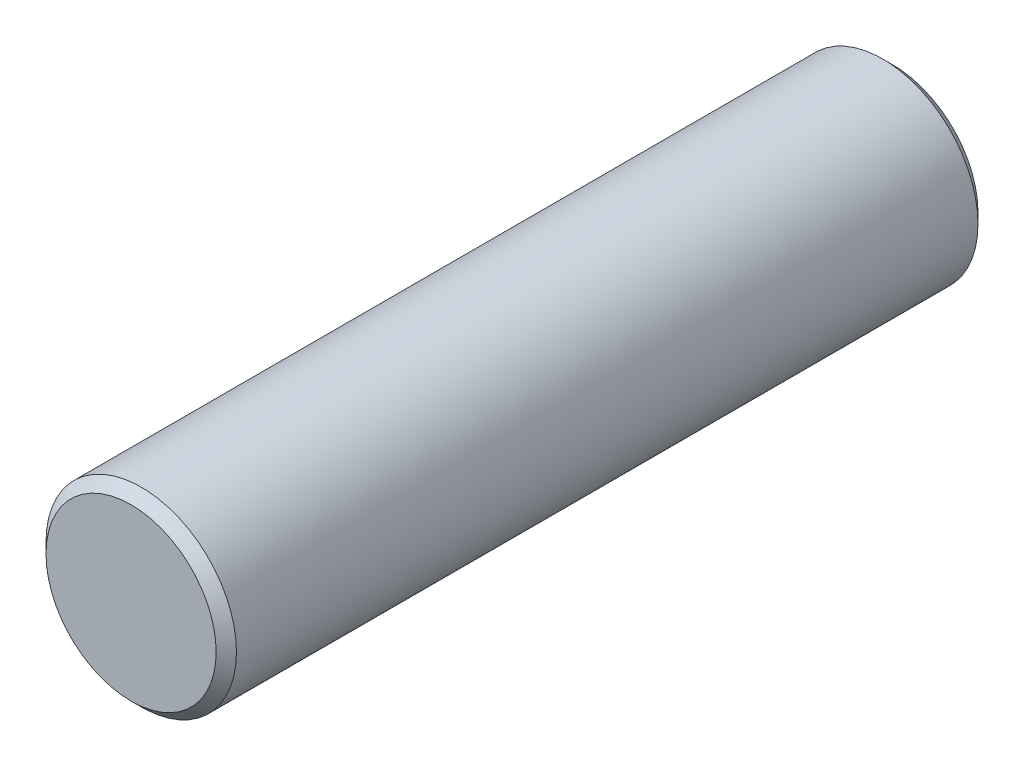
ISO-10303-21;
HEADER;
FILE_DESCRIPTION(('STEP AP214'),'2;1');
FILE_NAME('part.step','',(''),(''),'','','');
FILE_SCHEMA(('AUTOMOTIVE_DESIGN { 1 0 10303 214 1 1 1 1 }'));
ENDSEC;
DATA;
#1=APPLICATION_CONTEXT('core data for automotive mechanical design processes');
#2=APPLICATION_PROTOCOL_DEFINITION('international standard','automotive_design',2000,#1);
#3=PRODUCT_CONTEXT('',#1,'mechanical');
#4=PRODUCT('Part','Part','',(#3));
#5=PRODUCT_RELATED_PRODUCT_CATEGORY('part','',(#4));
#6=PRODUCT_DEFINITION_FORMATION('','',#4);
#7=PRODUCT_DEFINITION_CONTEXT('part definition',#1,'design');
#8=PRODUCT_DEFINITION('design','',#6,#7);
#9=PRODUCT_DEFINITION_SHAPE('','',#8);
#10=(LENGTH_UNIT() NAMED_UNIT(*) SI_UNIT(.MILLI.,.METRE.));
#11=(NAMED_UNIT(*) PLANE_ANGLE_UNIT() SI_UNIT($,.RADIAN.));
#12=(NAMED_UNIT(*) SI_UNIT($,.STERADIAN.) SOLID_ANGLE_UNIT());
#13=UNCERTAINTY_MEASURE_WITH_UNIT(LENGTH_MEASURE(1.E-05),#10,'distance_accuracy_value','');
#14=(GEOMETRIC_REPRESENTATION_CONTEXT(3) GLOBAL_UNCERTAINTY_ASSIGNED_CONTEXT((#13)) GLOBAL_UNIT_ASSIGNED_CONTEXT((#10,
#11,#12)) REPRESENTATION_CONTEXT('',''));
#15=CARTESIAN_POINT('',(0.,0.,0.));
#16=DIRECTION('',(0.,0.,1.));
#17=DIRECTION('',(1.,0.,0.));
#18=AXIS2_PLACEMENT_3D('',#15,#16,#17);
#19=CARTESIAN_POINT('',(0.,0.,9.525));
#20=DIRECTION('',(0.,0.,-1.));
#21=DIRECTION('',(-1.,0.,0.));
#22=AXIS2_PLACEMENT_3D('',#19,#20,#21);
#23=CYLINDRICAL_SURFACE('',#22,1.190625);
#24=CARTESIAN_POINT('',(0.,0.,0.127000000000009));
#25=DIRECTION('',(0.,0.,1.));
#26=DIRECTION('',(1.,0.,0.));
#27=AXIS2_PLACEMENT_3D('',#24,#25,#26);
#28=CIRCLE('',#27,1.190625);
#29=CARTESIAN_POINT('',(-1.190625,0.,0.127000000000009));
#30=VERTEX_POINT('',#29);
#31=EDGE_CURVE('E40',#30,#30,#28,.T.);
#32=CARTESIAN_POINT('',(0.,0.,9.39800000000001));
#33=DIRECTION('',(0.,0.,1.));
#34=DIRECTION('',(1.,0.,0.));
#35=AXIS2_PLACEMENT_3D('',#32,#33,#34);
#36=CIRCLE('',#35,1.190625);
#37=CARTESIAN_POINT('',(-1.190625,0.,9.39800000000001));
#38=VERTEX_POINT('',#37);
#39=EDGE_CURVE('E44',#38,#38,#36,.F.);
#40=CARTESIAN_POINT('',(-1.190625,0.,0.127000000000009));
#41=CARTESIAN_POINT('',(-1.190625,0.,0.223572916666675));
#42=CARTESIAN_POINT('',(-1.190625,0.,0.320145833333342));
#43=CARTESIAN_POINT('',(-1.190625,0.,0.513291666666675));
#44=CARTESIAN_POINT('',(-1.190625,0.,0.609864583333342));
#45=CARTESIAN_POINT('',(-1.190625,0.,0.803010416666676));
#46=CARTESIAN_POINT('',(-1.190625,0.,0.899583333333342));
#47=CARTESIAN_POINT('',(-1.190625,0.,1.09272916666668));
#48=CARTESIAN_POINT('',(-1.190625,0.,1.18930208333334));
#49=CARTESIAN_POINT('',(-1.190625,0.,1.38244791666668));
#50=CARTESIAN_POINT('',(-1.190625,0.,1.47902083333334));
#51=CARTESIAN_POINT('',(-1.190625,0.,1.67216666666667));
#52=CARTESIAN_POINT('',(-1.190625,0.,1.76873958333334));
#53=CARTESIAN_POINT('',(-1.190625,0.,1.96188541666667));
#54=CARTESIAN_POINT('',(-1.190625,0.,2.05845833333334));
#55=CARTESIAN_POINT('',(-1.190625,0.,2.25160416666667));
#56=CARTESIAN_POINT('',(-1.190625,0.,2.34817708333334));
#57=CARTESIAN_POINT('',(-1.190625,0.,2.54132291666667));
#58=CARTESIAN_POINT('',(-1.190625,0.,2.63789583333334));
#59=CARTESIAN_POINT('',(-1.190625,0.,2.83104166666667));
#60=CARTESIAN_POINT('',(-1.190625,0.,2.92761458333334));
#61=CARTESIAN_POINT('',(-1.190625,0.,3.12076041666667));
#62=CARTESIAN_POINT('',(-1.190625,0.,3.21733333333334));
#63=CARTESIAN_POINT('',(-1.190625,0.,3.41047916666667));
#64=CARTESIAN_POINT('',(-1.190625,0.,3.50705208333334));
#65=CARTESIAN_POINT('',(-1.190625,0.,3.70019791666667));
#66=CARTESIAN_POINT('',(-1.190625,0.,3.79677083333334));
#67=CARTESIAN_POINT('',(-1.190625,0.,3.98991666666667));
#68=CARTESIAN_POINT('',(-1.190625,0.,4.08648958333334));
#69=CARTESIAN_POINT('',(-1.190625,0.,4.27963541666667));
#70=CARTESIAN_POINT('',(-1.190625,0.,4.37620833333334));
#71=CARTESIAN_POINT('',(-1.190625,0.,4.56935416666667));
#72=CARTESIAN_POINT('',(-1.190625,0.,4.66592708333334));
#73=CARTESIAN_POINT('',(-1.190625,0.,4.85907291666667));
#74=CARTESIAN_POINT('',(-1.190625,0.,4.95564583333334));
#75=CARTESIAN_POINT('',(-1.190625,0.,5.14879166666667));
#76=CARTESIAN_POINT('',(-1.190625,0.,5.24536458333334));
#77=CARTESIAN_POINT('',(-1.190625,0.,5.43851041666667));
#78=CARTESIAN_POINT('',(-1.190625,0.,5.53508333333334));
#79=CARTESIAN_POINT('',(-1.190625,0.,5.72822916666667));
#80=CARTESIAN_POINT('',(-1.190625,0.,5.82480208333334));
#81=CARTESIAN_POINT('',(-1.190625,0.,6.01794791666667));
#82=CARTESIAN_POINT('',(-1.190625,0.,6.11452083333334));
#83=CARTESIAN_POINT('',(-1.190625,0.,6.30766666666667));
#84=CARTESIAN_POINT('',(-1.190625,0.,6.40423958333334));
#85=CARTESIAN_POINT('',(-1.190625,0.,6.59738541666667));
#86=CARTESIAN_POINT('',(-1.190625,0.,6.69395833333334));
#87=CARTESIAN_POINT('',(-1.190625,0.,6.88710416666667));
#88=CARTESIAN_POINT('',(-1.190625,0.,6.98367708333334));
#89=CARTESIAN_POINT('',(-1.190625,0.,7.17682291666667));
#90=CARTESIAN_POINT('',(-1.190625,0.,7.27339583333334));
#91=CARTESIAN_POINT('',(-1.190625,0.,7.46654166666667));
#92=CARTESIAN_POINT('',(-1.190625,0.,7.56311458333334));
#93=CARTESIAN_POINT('',(-1.190625,0.,7.75626041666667));
#94=CARTESIAN_POINT('',(-1.190625,0.,7.85283333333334));
#95=CARTESIAN_POINT('',(-1.190625,0.,8.04597916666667));
#96=CARTESIAN_POINT('',(-1.190625,0.,8.14255208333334));
#97=CARTESIAN_POINT('',(-1.190625,0.,8.33569791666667));
#98=CARTESIAN_POINT('',(-1.190625,0.,8.43227083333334));
#99=CARTESIAN_POINT('',(-1.190625,0.,8.62541666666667));
#100=CARTESIAN_POINT('',(-1.190625,0.,8.72198958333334));
#101=CARTESIAN_POINT('',(-1.190625,0.,8.91513541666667));
#102=CARTESIAN_POINT('',(-1.190625,0.,9.01170833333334));
#103=CARTESIAN_POINT('',(-1.190625,0.,9.20485416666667));
#104=CARTESIAN_POINT('',(-1.190625,0.,9.30142708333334));
#105=CARTESIAN_POINT('',(-1.190625,0.,9.39800000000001));
#106=B_SPLINE_CURVE_WITH_KNOTS('',3,(#40,#41,#42,#43,#44,#45,#46,#47,#48,#49,#50,#51,#52,#53,
#54,#55,#56,#57,#58,#59,#60,#61,#62,#63,#64,#65,#66,#67,#68,#69,#70,#71,#72,#73,#74,#75,#76,#77,
#78,#79,#80,#81,#82,#83,#84,#85,#86,#87,#88,#89,#90,#91,#92,#93,#94,#95,#96,#97,#98,#99,#100,
#101,#102,#103,#104,#105),.UNSPECIFIED.,.F.,.F.,(4,2,2,2,2,2,2,2,2,2,2,2,2,2,2,2,2,2,2,2,2,2,2,
2,2,2,2,2,2,2,2,2,4),(0.,0.289718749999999,0.5794375,0.869156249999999,1.158875,1.44859375,
1.7383125,2.02803125,2.31775,2.60746875,2.8971875,3.18690625,3.476625,3.76634375,4.0560625,
4.34578125,4.6355,4.92521875,5.2149375,5.50465625,5.794375,6.08409375,6.3738125,6.66353125,
6.95325,7.24296875,7.5326875,7.82240625,8.112125,8.40184375,8.6915625,8.98128125,9.271),.UNSPECIFIED.);
#107=EDGE_CURVE('BSEAM29',#30,#38,#106,.T.);
#108=ORIENTED_EDGE('',*,*,#31,.T.);
#109=ORIENTED_EDGE('',*,*,#39,.T.);
#110=ORIENTED_EDGE('',*,*,#107,.T.);
#111=ORIENTED_EDGE('',*,*,#107,.F.);
#112=EDGE_LOOP('',(#108,#110,#109,#111));
#113=FACE_BOUND('',#112,.T.);
#114=ADVANCED_FACE('F29',(#113),#23,.T.);
#115=CARTESIAN_POINT('',(0.,0.,9.525));
#116=DIRECTION('',(0.,0.,1.));
#117=DIRECTION('',(1.,0.,0.));
#118=AXIS2_PLACEMENT_3D('',#115,#116,#117);
#119=PLANE('',#118);
#120=CARTESIAN_POINT('',(0.,0.,9.525));
#121=DIRECTION('',(0.,0.,1.));
#122=DIRECTION('',(1.,0.,0.));
#123=AXIS2_PLACEMENT_3D('',#120,#121,#122);
#124=CIRCLE('',#123,1.06362500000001);
#125=CARTESIAN_POINT('',(1.06362500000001,0.,9.525));
#126=VERTEX_POINT('',#125);
#127=EDGE_CURVE('E10',#126,#126,#124,.T.);
#128=ORIENTED_EDGE('',*,*,#127,.T.);
#129=EDGE_LOOP('',(#128));
#130=FACE_BOUND('',#129,.T.);
#131=ADVANCED_FACE('F60',(#130),#119,.T.);
#132=CARTESIAN_POINT('',(0.,0.,0.));
#133=DIRECTION('',(0.,0.,1.));
#134=DIRECTION('',(1.,0.,0.));
#135=AXIS2_PLACEMENT_3D('',#132,#133,#134);
#136=PLANE('',#135);
#137=CARTESIAN_POINT('',(0.,0.,0.));
#138=DIRECTION('',(0.,0.,1.));
#139=DIRECTION('',(1.,0.,0.));
#140=AXIS2_PLACEMENT_3D('',#137,#138,#139);
#141=CIRCLE('',#140,1.06362499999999);
#142=CARTESIAN_POINT('',(1.06362499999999,0.,0.));
#143=VERTEX_POINT('',#142);
#144=EDGE_CURVE('E36',#143,#143,#141,.F.);
#145=ORIENTED_EDGE('',*,*,#144,.T.);
#146=EDGE_LOOP('',(#145));
#147=FACE_BOUND('',#146,.T.);
#148=ADVANCED_FACE('F57',(#147),#136,.F.);
#149=CARTESIAN_POINT('',(0.,0.,0.127000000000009));
#150=DIRECTION('',(0.,0.,1.));
#151=DIRECTION('',(1.,0.,0.));
#152=AXIS2_PLACEMENT_3D('',#149,#150,#151);
#153=CONICAL_SURFACE('',#152,1.190625,0.785398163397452);
#154=ORIENTED_EDGE('',*,*,#144,.F.);
#155=EDGE_LOOP('',(#154));
#156=FACE_BOUND('',#155,.T.);
#157=ORIENTED_EDGE('',*,*,#31,.F.);
#158=EDGE_LOOP('',(#157));
#159=FACE_BOUND('',#158,.T.);
#160=ADVANCED_FACE('F53',(#156,#159),#153,.T.);
#161=CARTESIAN_POINT('',(0.,0.,9.525));
#162=DIRECTION('',(0.,0.,-1.));
#163=DIRECTION('',(-1.,0.,0.));
#164=AXIS2_PLACEMENT_3D('',#161,#162,#163);
#165=CONICAL_SURFACE('',#164,1.06362500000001,0.785398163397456);
#166=ORIENTED_EDGE('',*,*,#39,.F.);
#167=EDGE_LOOP('',(#166));
#168=FACE_BOUND('',#167,.T.);
#169=ORIENTED_EDGE('',*,*,#127,.F.);
#170=EDGE_LOOP('',(#169));
#171=FACE_BOUND('',#170,.T.);
#172=ADVANCED_FACE('F31',(#168,#171),#165,.T.);
#173=CLOSED_SHELL('',(#114,#131,#148,#160,#172));
#174=MANIFOLD_SOLID_BREP('B2',#173);
#175=ADVANCED_BREP_SHAPE_REPRESENTATION('',(#18,#174),#14);
#176=SHAPE_DEFINITION_REPRESENTATION(#9,#175);
ENDSEC;
END-ISO-10303-21;
